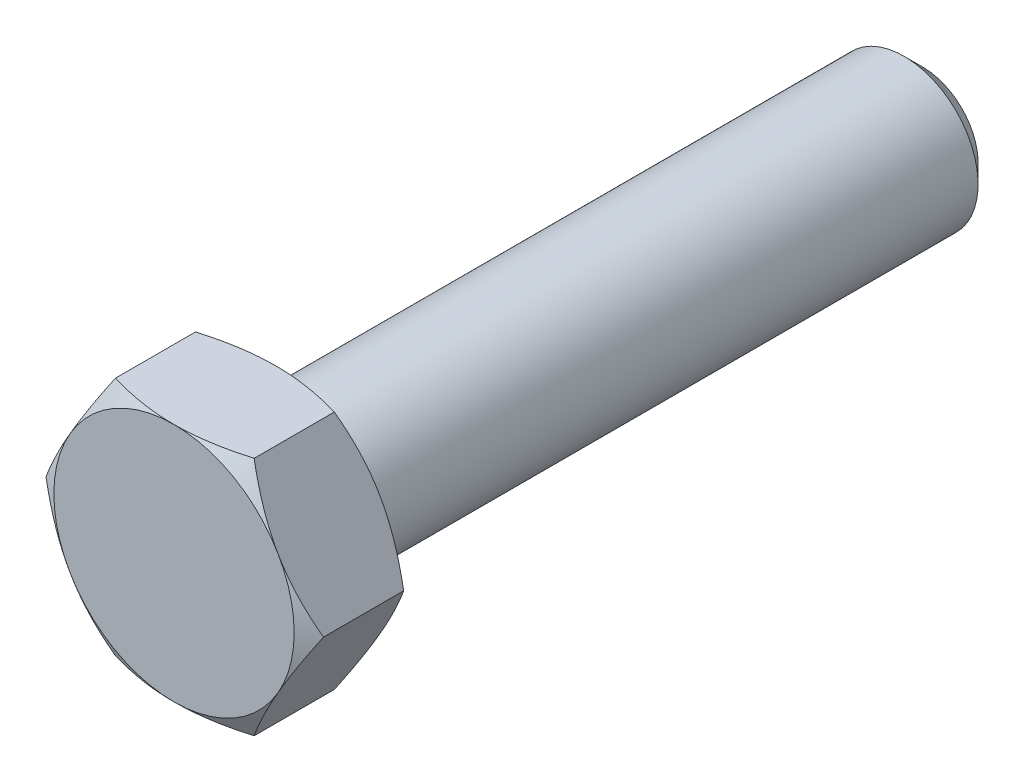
ISO-10303-21;
HEADER;
FILE_DESCRIPTION(('STEP AP214'),'2;1');
FILE_NAME('part.step','',(''),(''),'','','');
FILE_SCHEMA(('AUTOMOTIVE_DESIGN { 1 0 10303 214 1 1 1 1 }'));
ENDSEC;
DATA;
#1=APPLICATION_CONTEXT('core data for automotive mechanical design processes');
#2=APPLICATION_PROTOCOL_DEFINITION('international standard','automotive_design',2000,#1);
#3=PRODUCT_CONTEXT('',#1,'mechanical');
#4=PRODUCT('Part','Part','',(#3));
#5=PRODUCT_RELATED_PRODUCT_CATEGORY('part','',(#4));
#6=PRODUCT_DEFINITION_FORMATION('','',#4);
#7=PRODUCT_DEFINITION_CONTEXT('part definition',#1,'design');
#8=PRODUCT_DEFINITION('design','',#6,#7);
#9=PRODUCT_DEFINITION_SHAPE('','',#8);
#10=(LENGTH_UNIT() NAMED_UNIT(*) SI_UNIT(.MILLI.,.METRE.));
#11=(NAMED_UNIT(*) PLANE_ANGLE_UNIT() SI_UNIT($,.RADIAN.));
#12=(NAMED_UNIT(*) SI_UNIT($,.STERADIAN.) SOLID_ANGLE_UNIT());
#13=UNCERTAINTY_MEASURE_WITH_UNIT(LENGTH_MEASURE(1.E-05),#10,'distance_accuracy_value','');
#14=(GEOMETRIC_REPRESENTATION_CONTEXT(3) GLOBAL_UNCERTAINTY_ASSIGNED_CONTEXT((#13)) GLOBAL_UNIT_ASSIGNED_CONTEXT((#10,
#11,#12)) REPRESENTATION_CONTEXT('',''));
#15=CARTESIAN_POINT('',(0.,0.,0.));
#16=DIRECTION('',(0.,0.,1.));
#17=DIRECTION('',(1.,0.,0.));
#18=AXIS2_PLACEMENT_3D('',#15,#16,#17);
#19=CARTESIAN_POINT('',(0.,13.,0.));
#20=DIRECTION('',(0.,0.,-1.));
#21=DIRECTION('',(-1.,0.,0.));
#22=AXIS2_PLACEMENT_3D('',#19,#20,#21);
#23=PLANE('',#22);
#24=CARTESIAN_POINT('',(0.,0.,0.));
#25=DIRECTION('',(0.,0.,-1.));
#26=DIRECTION('',(-1.,0.,0.));
#27=AXIS2_PLACEMENT_3D('',#24,#25,#26);
#28=CIRCLE('',#27,6.5);
#29=CARTESIAN_POINT('',(-5.62916512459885,-3.25,0.));
#30=VERTEX_POINT('',#29);
#31=CARTESIAN_POINT('',(-5.62916512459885,3.25,0.));
#32=VERTEX_POINT('',#31);
#33=EDGE_CURVE('E310',#30,#32,#28,.T.);
#34=ORIENTED_EDGE('',*,*,#33,.T.);
#35=CARTESIAN_POINT('',(0.,0.,0.));
#36=DIRECTION('',(0.,0.,-1.));
#37=DIRECTION('',(-1.,0.,0.));
#38=AXIS2_PLACEMENT_3D('',#35,#36,#37);
#39=CIRCLE('',#38,6.5);
#40=CARTESIAN_POINT('',(0.,6.5,0.));
#41=VERTEX_POINT('',#40);
#42=EDGE_CURVE('E249',#32,#41,#39,.T.);
#43=ORIENTED_EDGE('',*,*,#42,.T.);
#44=CARTESIAN_POINT('',(5.62916512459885,3.25,0.));
#45=VERTEX_POINT('',#44);
#46=EDGE_CURVE('E142',#41,#45,#28,.T.);
#47=ORIENTED_EDGE('',*,*,#46,.T.);
#48=CARTESIAN_POINT('',(5.62916512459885,-3.25,0.));
#49=VERTEX_POINT('',#48);
#50=EDGE_CURVE('E303',#45,#49,#28,.T.);
#51=ORIENTED_EDGE('',*,*,#50,.T.);
#52=CARTESIAN_POINT('',(0.,-6.5,0.));
#53=VERTEX_POINT('',#52);
#54=EDGE_CURVE('E300',#49,#53,#28,.T.);
#55=ORIENTED_EDGE('',*,*,#54,.T.);
#56=EDGE_CURVE('E304',#53,#30,#28,.T.);
#57=ORIENTED_EDGE('',*,*,#56,.T.);
#58=EDGE_LOOP('',(#34,#43,#47,#51,#55,#57));
#59=FACE_BOUND('',#58,.T.);
#60=CARTESIAN_POINT('',(0.,0.,0.));
#61=DIRECTION('',(0.,0.,-1.));
#62=DIRECTION('',(-1.,0.,0.));
#63=AXIS2_PLACEMENT_3D('',#60,#61,#62);
#64=CIRCLE('',#63,4.);
#65=CARTESIAN_POINT('',(-4.,0.,0.));
#66=VERTEX_POINT('',#65);
#67=EDGE_CURVE('E156',#66,#66,#64,.T.);
#68=ORIENTED_EDGE('',*,*,#67,.F.);
#69=EDGE_LOOP('',(#68));
#70=FACE_BOUND('',#69,.T.);
#71=ADVANCED_FACE('F32',(#59,#70),#23,.T.);
#72=CARTESIAN_POINT('',(-7.50555349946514,0.,5.5));
#73=DIRECTION('',(-0.866025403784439,0.5,0.));
#74=DIRECTION('',(-0.5,-0.866025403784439,0.));
#75=AXIS2_PLACEMENT_3D('',#72,#73,#74);
#76=PLANE('',#75);
#77=DIRECTION('',(0.,0.,-1.));
#78=VECTOR('',#77,1.);
#79=CARTESIAN_POINT('',(-7.50555349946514,0.,5.5));
#80=LINE('',#79,#78);
#81=CARTESIAN_POINT('',(-7.50555349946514,0.,4.91944341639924));
#82=VERTEX_POINT('',#81);
#83=CARTESIAN_POINT('',(-7.50555349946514,0.,0.580556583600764));
#84=VERTEX_POINT('',#83);
#85=EDGE_CURVE('E312',#82,#84,#80,.T.);
#86=ORIENTED_EDGE('',*,*,#85,.F.);
#87=CARTESIAN_POINT('',(-7.50566896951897,-0.000200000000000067,4.91937674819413));
#88=CARTESIAN_POINT('',(-7.4231786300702,0.142677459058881,4.96699557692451));
#89=CARTESIAN_POINT('',(-7.34038072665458,0.286087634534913,5.01245329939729));
#90=CARTESIAN_POINT('',(-7.17411251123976,0.574072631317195,5.09845131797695));
#91=CARTESIAN_POINT('',(-7.09064192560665,0.718647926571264,5.13898949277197));
#92=CARTESIAN_POINT('',(-6.83889369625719,1.15468865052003,5.25242899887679));
#93=CARTESIAN_POINT('',(-6.66962231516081,1.44787528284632,5.31695219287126));
#94=CARTESIAN_POINT('',(-6.41631077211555,1.88662374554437,5.39261341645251));
#95=CARTESIAN_POINT('',(-6.33302748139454,2.03087463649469,5.41416714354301));
#96=CARTESIAN_POINT('',(-6.16608458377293,2.32002821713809,5.45030968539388));
#97=CARTESIAN_POINT('',(-6.08242501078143,2.46493084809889,5.46489911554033));
#98=CARTESIAN_POINT('',(-5.91496056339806,2.75498777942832,5.48674124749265));
#99=CARTESIAN_POINT('',(-5.8311559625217,2.90014160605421,5.49400227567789));
#100=CARTESIAN_POINT('',(-5.66347396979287,3.19057533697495,5.50103969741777));
#101=CARTESIAN_POINT('',(-5.5795965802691,3.33585523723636,5.50081632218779));
#102=CARTESIAN_POINT('',(-5.34979921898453,3.73387594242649,5.48991654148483));
#103=CARTESIAN_POINT('',(-5.20395446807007,3.98648646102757,5.47161818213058));
#104=CARTESIAN_POINT('',(-4.91323365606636,4.49002967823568,5.41359365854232));
#105=CARTESIAN_POINT('',(-4.76835861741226,4.74096060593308,5.37384766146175));
#106=CARTESIAN_POINT('',(-4.47705272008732,5.24551722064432,5.27449409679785));
#107=CARTESIAN_POINT('',(-4.33065861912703,5.49907924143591,5.21446557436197));
#108=CARTESIAN_POINT('',(-4.04005357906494,6.00242193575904,5.07822500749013));
#109=CARTESIAN_POINT('',(-3.89583891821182,6.25220905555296,5.00204496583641));
#110=CARTESIAN_POINT('',(-3.75266127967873,6.5002,4.91937674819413));
#111=B_SPLINE_CURVE_WITH_KNOTS('',3,(#87,#88,#89,#90,#91,#92,#93,#94,#95,#96,#97,#98,#99,#100,
#101,#102,#103,#104,#105,#106,#107,#108,#109,#110),.UNSPECIFIED.,.F.,.F.,(4,2,2,2,2,2,2,2,2,2,2,
4),(0.,0.515105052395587,1.03043143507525,2.06322554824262,2.56697389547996,3.07067772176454,
3.57380860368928,4.0769239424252,4.9527935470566,5.82947446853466,6.72559912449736,
7.61996451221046),.UNSPECIFIED.);
#112=CARTESIAN_POINT('',(-5.62916512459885,3.25,5.5));
#113=VERTEX_POINT('',#112);
#114=EDGE_CURVE('E233',#82,#113,#111,.T.);
#115=ORIENTED_EDGE('',*,*,#114,.T.);
#116=CARTESIAN_POINT('',(-3.75277674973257,6.5,4.91944341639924));
#117=VERTEX_POINT('',#116);
#118=EDGE_CURVE('E129',#113,#117,#111,.T.);
#119=ORIENTED_EDGE('',*,*,#118,.T.);
#120=DIRECTION('',(0.,0.,-1.));
#121=VECTOR('',#120,1.);
#122=CARTESIAN_POINT('',(-3.75277674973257,6.5,5.5));
#123=LINE('',#122,#121);
#124=CARTESIAN_POINT('',(-3.75277674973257,6.5,0.580556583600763));
#125=VERTEX_POINT('',#124);
#126=EDGE_CURVE('E147',#117,#125,#123,.T.);
#127=ORIENTED_EDGE('',*,*,#126,.T.);
#128=CARTESIAN_POINT('',(-3.75266127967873,6.5002,0.580623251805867));
#129=CARTESIAN_POINT('',(-3.8351516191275,6.35732254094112,0.533004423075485));
#130=CARTESIAN_POINT('',(-3.91794952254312,6.21391236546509,0.487546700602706));
#131=CARTESIAN_POINT('',(-4.08421773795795,5.9259273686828,0.401548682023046));
#132=CARTESIAN_POINT('',(-4.16768832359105,5.78135207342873,0.361010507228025));
#133=CARTESIAN_POINT('',(-4.41943655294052,5.34531134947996,0.247571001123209));
#134=CARTESIAN_POINT('',(-4.5887079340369,5.05212471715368,0.18304780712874));
#135=CARTESIAN_POINT('',(-4.84201947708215,4.61337625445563,0.107386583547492));
#136=CARTESIAN_POINT('',(-4.92530276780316,4.46912536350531,0.0858328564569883));
#137=CARTESIAN_POINT('',(-5.09224566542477,4.17997178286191,0.0496903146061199));
#138=CARTESIAN_POINT('',(-5.17590523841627,4.03506915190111,0.0351008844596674));
#139=CARTESIAN_POINT('',(-5.34336968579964,3.74501222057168,0.0132587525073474));
#140=CARTESIAN_POINT('',(-5.427174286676,3.59985839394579,0.00599772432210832));
#141=CARTESIAN_POINT('',(-5.59485627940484,3.30942466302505,-0.00103969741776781));
#142=CARTESIAN_POINT('',(-5.6787336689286,3.16414476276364,-0.000816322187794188));
#143=CARTESIAN_POINT('',(-5.90853103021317,2.7661240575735,0.0100834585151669));
#144=CARTESIAN_POINT('',(-6.05437578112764,2.51351353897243,0.0283818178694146));
#145=CARTESIAN_POINT('',(-6.34509659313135,2.00997032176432,0.0864063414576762));
#146=CARTESIAN_POINT('',(-6.48997163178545,1.75903939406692,0.126152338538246));
#147=CARTESIAN_POINT('',(-6.78127752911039,1.25448277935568,0.225505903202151));
#148=CARTESIAN_POINT('',(-6.92767163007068,1.00092075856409,0.285534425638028));
#149=CARTESIAN_POINT('',(-7.21827667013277,0.497578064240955,0.421774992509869));
#150=CARTESIAN_POINT('',(-7.36249133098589,0.247790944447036,0.497955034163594));
#151=CARTESIAN_POINT('',(-7.50566896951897,-0.00020000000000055,0.580623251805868));
#152=B_SPLINE_CURVE_WITH_KNOTS('',3,(#128,#129,#130,#131,#132,#133,#134,#135,#136,#137,#138,
#139,#140,#141,#142,#143,#144,#145,#146,#147,#148,#149,#150,#151),.UNSPECIFIED.,.F.,.F.,(4,2,2,
2,2,2,2,2,2,2,2,4),(0.,0.515105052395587,1.03043143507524,2.06322554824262,2.56697389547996,
3.07067772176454,3.57380860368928,4.0769239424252,4.9527935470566,5.82947446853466,
6.72559912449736,7.61996451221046),.UNSPECIFIED.);
#153=EDGE_CURVE('E315',#125,#32,#152,.T.);
#154=ORIENTED_EDGE('',*,*,#153,.T.);
#155=EDGE_CURVE('E322',#32,#84,#152,.T.);
#156=ORIENTED_EDGE('',*,*,#155,.T.);
#157=EDGE_LOOP('',(#86,#115,#119,#127,#154,#156));
#158=FACE_BOUND('',#157,.T.);
#159=ADVANCED_FACE('F34',(#158),#76,.T.);
#160=CARTESIAN_POINT('',(-3.75277674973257,-6.5,5.5));
#161=DIRECTION('',(-0.866025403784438,-0.500000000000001,0.));
#162=DIRECTION('',(0.500000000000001,-0.866025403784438,0.));
#163=AXIS2_PLACEMENT_3D('',#160,#161,#162);
#164=PLANE('',#163);
#165=DIRECTION('',(0.,0.,-1.));
#166=VECTOR('',#165,1.);
#167=CARTESIAN_POINT('',(-3.75277674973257,-6.5,5.5));
#168=LINE('',#167,#166);
#169=CARTESIAN_POINT('',(-3.75277674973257,-6.5,4.91944341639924));
#170=VERTEX_POINT('',#169);
#171=CARTESIAN_POINT('',(-3.75277674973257,-6.5,0.580556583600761));
#172=VERTEX_POINT('',#171);
#173=EDGE_CURVE('E320',#170,#172,#168,.T.);
#174=ORIENTED_EDGE('',*,*,#173,.F.);
#175=CARTESIAN_POINT('',(-3.75266127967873,-6.5002,4.91937674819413));
#176=CARTESIAN_POINT('',(-3.8351516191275,-6.35732254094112,4.96699557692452));
#177=CARTESIAN_POINT('',(-3.91794952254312,-6.21391236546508,5.01245329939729));
#178=CARTESIAN_POINT('',(-4.08421773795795,-5.9259273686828,5.09845131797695));
#179=CARTESIAN_POINT('',(-4.16768832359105,-5.78135207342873,5.13898949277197));
#180=CARTESIAN_POINT('',(-4.41943655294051,-5.34531134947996,5.25242899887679));
#181=CARTESIAN_POINT('',(-4.5887079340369,-5.05212471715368,5.31695219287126));
#182=CARTESIAN_POINT('',(-4.84201947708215,-4.61337625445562,5.39261341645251));
#183=CARTESIAN_POINT('',(-4.92530276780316,-4.46912536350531,5.41416714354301));
#184=CARTESIAN_POINT('',(-5.09224566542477,-4.17997178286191,5.45030968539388));
#185=CARTESIAN_POINT('',(-5.17590523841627,-4.03506915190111,5.46489911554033));
#186=CARTESIAN_POINT('',(-5.34336968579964,-3.74501222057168,5.48674124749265));
#187=CARTESIAN_POINT('',(-5.427174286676,-3.59985839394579,5.49400227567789));
#188=CARTESIAN_POINT('',(-5.59485627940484,-3.30942466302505,5.50103969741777));
#189=CARTESIAN_POINT('',(-5.6787336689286,-3.16414476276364,5.5008163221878));
#190=CARTESIAN_POINT('',(-5.90853103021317,-2.7661240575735,5.48991654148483));
#191=CARTESIAN_POINT('',(-6.05437578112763,-2.51351353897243,5.47161818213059));
#192=CARTESIAN_POINT('',(-6.34509659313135,-2.00997032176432,5.41359365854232));
#193=CARTESIAN_POINT('',(-6.48997163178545,-1.75903939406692,5.37384766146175));
#194=CARTESIAN_POINT('',(-6.78127752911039,-1.25448277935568,5.27449409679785));
#195=CARTESIAN_POINT('',(-6.92767163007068,-1.00092075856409,5.21446557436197));
#196=CARTESIAN_POINT('',(-7.21827667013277,-0.497578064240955,5.07822500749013));
#197=CARTESIAN_POINT('',(-7.36249133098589,-0.247790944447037,5.00204496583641));
#198=CARTESIAN_POINT('',(-7.50566896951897,0.00019999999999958,4.91937674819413));
#199=B_SPLINE_CURVE_WITH_KNOTS('',3,(#175,#176,#177,#178,#179,#180,#181,#182,#183,#184,#185,
#186,#187,#188,#189,#190,#191,#192,#193,#194,#195,#196,#197,#198),.UNSPECIFIED.,.F.,.F.,(4,2,2,
2,2,2,2,2,2,2,2,4),(0.,0.515105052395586,1.03043143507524,2.06322554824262,2.56697389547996,
3.07067772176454,3.57380860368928,4.0769239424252,4.9527935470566,5.82947446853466,
6.72559912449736,7.61996451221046),.UNSPECIFIED.);
#200=CARTESIAN_POINT('',(-5.62916512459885,-3.25,5.5));
#201=VERTEX_POINT('',#200);
#202=EDGE_CURVE('E56',#170,#201,#199,.T.);
#203=ORIENTED_EDGE('',*,*,#202,.T.);
#204=EDGE_CURVE('E195',#201,#82,#199,.T.);
#205=ORIENTED_EDGE('',*,*,#204,.T.);
#206=ORIENTED_EDGE('',*,*,#85,.T.);
#207=CARTESIAN_POINT('',(-7.50566896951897,0.0002,0.580623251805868));
#208=CARTESIAN_POINT('',(-7.4231786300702,-0.142677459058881,0.533004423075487));
#209=CARTESIAN_POINT('',(-7.34038072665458,-0.286087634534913,0.487546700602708));
#210=CARTESIAN_POINT('',(-7.17411251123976,-0.574072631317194,0.401548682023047));
#211=CARTESIAN_POINT('',(-7.09064192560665,-0.718647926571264,0.361010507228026));
#212=CARTESIAN_POINT('',(-6.83889369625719,-1.15468865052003,0.247571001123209));
#213=CARTESIAN_POINT('',(-6.66962231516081,-1.44787528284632,0.18304780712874));
#214=CARTESIAN_POINT('',(-6.41631077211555,-1.88662374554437,0.107386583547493));
#215=CARTESIAN_POINT('',(-6.33302748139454,-2.03087463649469,0.0858328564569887));
#216=CARTESIAN_POINT('',(-6.16608458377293,-2.32002821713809,0.0496903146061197));
#217=CARTESIAN_POINT('',(-6.08242501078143,-2.46493084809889,0.0351008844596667));
#218=CARTESIAN_POINT('',(-5.91496056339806,-2.75498777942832,0.013258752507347));
#219=CARTESIAN_POINT('',(-5.8311559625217,-2.90014160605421,0.00599772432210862));
#220=CARTESIAN_POINT('',(-5.66347396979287,-3.19057533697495,-0.00103969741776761));
#221=CARTESIAN_POINT('',(-5.5795965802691,-3.33585523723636,-0.000816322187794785));
#222=CARTESIAN_POINT('',(-5.34979921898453,-3.73387594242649,0.0100834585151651));
#223=CARTESIAN_POINT('',(-5.20395446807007,-3.98648646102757,0.0283818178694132));
#224=CARTESIAN_POINT('',(-4.91323365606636,-4.49002967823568,0.0864063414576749));
#225=CARTESIAN_POINT('',(-4.76835861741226,-4.74096060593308,0.126152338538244));
#226=CARTESIAN_POINT('',(-4.47705272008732,-5.24551722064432,0.225505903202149));
#227=CARTESIAN_POINT('',(-4.33065861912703,-5.49907924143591,0.285534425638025));
#228=CARTESIAN_POINT('',(-4.04005357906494,-6.00242193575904,0.421774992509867));
#229=CARTESIAN_POINT('',(-3.89583891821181,-6.25220905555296,0.497955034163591));
#230=CARTESIAN_POINT('',(-3.75266127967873,-6.5002,0.580623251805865));
#231=B_SPLINE_CURVE_WITH_KNOTS('',3,(#207,#208,#209,#210,#211,#212,#213,#214,#215,#216,#217,
#218,#219,#220,#221,#222,#223,#224,#225,#226,#227,#228,#229,#230),.UNSPECIFIED.,.F.,.F.,(4,2,2,
2,2,2,2,2,2,2,2,4),(0.,0.515105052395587,1.03043143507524,2.06322554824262,2.56697389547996,
3.07067772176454,3.57380860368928,4.0769239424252,4.9527935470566,5.82947446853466,
6.72559912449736,7.61996451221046),.UNSPECIFIED.);
#232=EDGE_CURVE('E327',#84,#30,#231,.T.);
#233=ORIENTED_EDGE('',*,*,#232,.T.);
#234=EDGE_CURVE('E188',#30,#172,#231,.T.);
#235=ORIENTED_EDGE('',*,*,#234,.T.);
#236=EDGE_LOOP('',(#174,#203,#205,#206,#233,#235));
#237=FACE_BOUND('',#236,.T.);
#238=ADVANCED_FACE('F169',(#237),#164,.T.);
#239=CARTESIAN_POINT('',(3.75277674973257,-6.5,5.5));
#240=DIRECTION('',(0.,-1.,0.));
#241=DIRECTION('',(1.,0.,0.));
#242=AXIS2_PLACEMENT_3D('',#239,#240,#241);
#243=PLANE('',#242);
#244=DIRECTION('',(0.,0.,-1.));
#245=VECTOR('',#244,1.);
#246=CARTESIAN_POINT('',(3.75277674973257,-6.5,5.5));
#247=LINE('',#246,#245);
#248=CARTESIAN_POINT('',(3.75277674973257,-6.5,4.91944341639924));
#249=VERTEX_POINT('',#248);
#250=CARTESIAN_POINT('',(3.75277674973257,-6.5,0.580556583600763));
#251=VERTEX_POINT('',#250);
#252=EDGE_CURVE('E294',#249,#251,#247,.T.);
#253=ORIENTED_EDGE('',*,*,#252,.F.);
#254=CARTESIAN_POINT('',(-9.97729078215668,-6.5,2.37778992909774));
#255=CARTESIAN_POINT('',(-9.69424196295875,-6.5,2.51467602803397));
#256=CARTESIAN_POINT('',(-9.41053219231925,-6.5,2.65021940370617));
#257=CARTESIAN_POINT('',(-8.84143883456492,-6.5,2.9178633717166));
#258=CARTESIAN_POINT('',(-8.55605498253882,-6.5,3.04996340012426));
#259=CARTESIAN_POINT('',(-7.98174100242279,-6.5,3.31065019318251));
#260=CARTESIAN_POINT('',(-7.69279995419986,-6.5,3.43921298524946));
#261=CARTESIAN_POINT('',(-7.11258334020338,-6.5,3.69093759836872));
#262=CARTESIAN_POINT('',(-6.82130788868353,-6.5,3.81409968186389));
#263=CARTESIAN_POINT('',(-6.22696298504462,-6.5,4.05727415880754));
#264=CARTESIAN_POINT('',(-5.92380598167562,-6.5,4.17707377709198));
#265=CARTESIAN_POINT('',(-5.3139080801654,-6.5,4.4073538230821));
#266=CARTESIAN_POINT('',(-5.00716677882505,-6.5,4.5178331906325));
#267=CARTESIAN_POINT('',(-4.3902168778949,-6.5,4.7264961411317));
#268=CARTESIAN_POINT('',(-4.08001710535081,-6.5,4.82470553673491));
#269=CARTESIAN_POINT('',(-3.4551811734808,-6.5,5.00561092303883));
#270=CARTESIAN_POINT('',(-3.14054647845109,-6.5,5.08831191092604));
#271=CARTESIAN_POINT('',(-2.50833584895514,-6.5,5.23372427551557));
#272=CARTESIAN_POINT('',(-2.19078462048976,-6.5,5.29654012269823));
#273=CARTESIAN_POINT('',(-1.71165005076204,-6.5,5.37308014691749));
#274=CARTESIAN_POINT('',(-1.55145779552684,-6.5,5.39564728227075));
#275=CARTESIAN_POINT('',(-1.2303133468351,-6.5,5.43444204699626));
#276=CARTESIAN_POINT('',(-1.06936123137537,-6.5,5.45067031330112));
#277=CARTESIAN_POINT('',(-0.748968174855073,-6.5,5.47626594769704));
#278=CARTESIAN_POINT('',(-0.589534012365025,-6.5,5.48571785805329));
#279=CARTESIAN_POINT('',(-0.270409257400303,-6.5,5.49787883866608));
#280=CARTESIAN_POINT('',(-0.110718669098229,-6.5,5.50058801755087));
#281=CARTESIAN_POINT('',(0.208634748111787,-6.5,5.49919908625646));
#282=CARTESIAN_POINT('',(0.368297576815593,-6.5,5.49510092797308));
#283=CARTESIAN_POINT('',(0.687311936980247,-6.5,5.48019557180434));
#284=CARTESIAN_POINT('',(0.846663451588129,-6.5,5.46938802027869));
#285=CARTESIAN_POINT('',(1.23282228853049,-6.5,5.43529329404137));
#286=CARTESIAN_POINT('',(1.45933886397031,-6.5,5.40864596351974));
#287=CARTESIAN_POINT('',(1.91061150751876,-6.5,5.34327257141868));
#288=CARTESIAN_POINT('',(2.1353673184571,-6.5,5.30454477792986));
#289=CARTESIAN_POINT('',(2.80678176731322,-6.5,5.17230120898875));
#290=CARTESIAN_POINT('',(3.25031976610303,-6.5,5.0627519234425));
#291=CARTESIAN_POINT('',(3.91338278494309,-6.5,4.87379149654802));
#292=CARTESIAN_POINT('',(4.13637192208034,-6.5,4.80584530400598));
#293=CARTESIAN_POINT('',(4.58018302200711,-6.5,4.66314671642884));
#294=CARTESIAN_POINT('',(4.80100497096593,-6.5,4.58839427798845));
#295=CARTESIAN_POINT('',(5.24055596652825,-6.5,4.43326153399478));
#296=CARTESIAN_POINT('',(5.45928573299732,-6.5,4.35288324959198));
#297=CARTESIAN_POINT('',(5.8949502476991,-6.5,4.18741937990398));
#298=CARTESIAN_POINT('',(6.11188501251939,-6.5,4.10233383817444));
#299=CARTESIAN_POINT('',(6.60444885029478,-6.5,3.90396155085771));
#300=CARTESIAN_POINT('',(6.87957453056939,-6.5,3.78942755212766));
#301=CARTESIAN_POINT('',(7.42764194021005,-6.5,3.55523525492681));
#302=CARTESIAN_POINT('',(7.70058356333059,-6.5,3.43557670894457));
#303=CARTESIAN_POINT('',(8.24466177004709,-6.5,3.19211434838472));
#304=CARTESIAN_POINT('',(8.51579804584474,-6.5,3.06830984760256));
#305=CARTESIAN_POINT('',(9.05651181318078,-6.5,2.81733776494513));
#306=CARTESIAN_POINT('',(9.32608927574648,-6.5,2.69017012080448));
#307=CARTESIAN_POINT('',(10.1333173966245,-6.5,2.30433583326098));
#308=CARTESIAN_POINT('',(10.6689977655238,-6.5,2.04154902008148));
#309=CARTESIAN_POINT('',(11.7365775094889,-6.5,1.50840571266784));
#310=CARTESIAN_POINT('',(12.2684767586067,-6.5,1.23804896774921));
#311=CARTESIAN_POINT('',(13.043539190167,-6.5,0.839062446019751));
#312=CARTESIAN_POINT('',(13.2878118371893,-6.5,0.712581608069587));
#313=CARTESIAN_POINT('',(13.7758255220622,-6.5,0.458608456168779));
#314=CARTESIAN_POINT('',(14.0195665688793,-6.5,0.331116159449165));
#315=CARTESIAN_POINT('',(14.7501146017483,-6.5,-0.0526879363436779));
#316=CARTESIAN_POINT('',(15.2362291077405,-6.5,-0.310317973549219));
#317=CARTESIAN_POINT('',(16.2059474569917,-6.5,-0.827706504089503));
#318=CARTESIAN_POINT('',(16.6895544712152,-6.5,-1.0874590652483));
#319=CARTESIAN_POINT('',(17.6555855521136,-6.5,-1.60909930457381));
#320=CARTESIAN_POINT('',(18.138009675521,-6.5,-1.87098687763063));
#321=CARTESIAN_POINT('',(18.6199925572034,-6.5,-2.13367898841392));
#322=B_SPLINE_CURVE_WITH_KNOTS('',3,(#254,#255,#256,#257,#258,#259,#260,#261,#262,#263,#264,
#265,#266,#267,#268,#269,#270,#271,#272,#273,#274,#275,#276,#277,#278,#279,#280,#281,#282,#283,
#284,#285,#286,#287,#288,#289,#290,#291,#292,#293,#294,#295,#296,#297,#298,#299,#300,#301,#302,
#303,#304,#305,#306,#307,#308,#309,#310,#311,#312,#313,#314,#315,#316,#317,#318,#319,#320,#321),
.UNSPECIFIED.,.F.,.F.,(4,2,2,2,2,2,2,2,2,2,2,2,2,2,2,2,2,2,2,2,2,2,2,2,2,2,2,2,2,2,2,2,2,4),(0.,
0.943245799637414,1.88664511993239,2.83535686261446,3.78402245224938,4.761812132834,
5.73971288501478,6.71552046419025,7.69101307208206,8.66129224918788,9.14650857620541,
9.63167613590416,10.1106800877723,10.5896763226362,11.0686759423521,11.5477008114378,
12.2315479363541,12.9154931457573,14.2841869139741,14.9834656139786,15.6827487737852,
16.3817819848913,17.0808087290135,17.9747819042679,18.8687983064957,19.7629634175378,
20.6571450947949,22.4470430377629,24.2370003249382,25.0622248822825,25.8874354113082,
27.5379151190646,29.1847624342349,30.831529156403),.UNSPECIFIED.);
#323=CARTESIAN_POINT('',(0.,-6.5,5.5));
#324=VERTEX_POINT('',#323);
#325=EDGE_CURVE('E245',#249,#324,#322,.F.);
#326=ORIENTED_EDGE('',*,*,#325,.T.);
#327=EDGE_CURVE('E206',#324,#170,#322,.F.);
#328=ORIENTED_EDGE('',*,*,#327,.T.);
#329=ORIENTED_EDGE('',*,*,#173,.T.);
#330=CARTESIAN_POINT('',(-9.97058141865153,-6.5,3.11896475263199));
#331=CARTESIAN_POINT('',(-9.68505665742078,-6.5,2.98091016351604));
#332=CARTESIAN_POINT('',(-9.39885881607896,-6.5,2.84422254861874));
#333=CARTESIAN_POINT('',(-8.82475313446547,-6.5,2.57436199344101));
#334=CARTESIAN_POINT('',(-8.53684501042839,-6.5,2.44118965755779));
#335=CARTESIAN_POINT('',(-7.95740836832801,-6.5,2.17844267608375));
#336=CARTESIAN_POINT('',(-7.66586857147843,-6.5,2.04889281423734));
#337=CARTESIAN_POINT('',(-7.08039928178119,-6.5,1.79533218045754));
#338=CARTESIAN_POINT('',(-6.78646991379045,-6.5,1.67132112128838));
#339=CARTESIAN_POINT('',(-6.19202314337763,-6.5,1.42880427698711));
#340=CARTESIAN_POINT('',(-5.89146936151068,-6.5,1.31038717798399));
#341=CARTESIAN_POINT('',(-5.28682280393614,-6.5,1.08278341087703));
#342=CARTESIAN_POINT('',(-4.98272963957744,-6.5,0.973597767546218));
#343=CARTESIAN_POINT('',(-4.37114030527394,-6.5,0.767377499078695));
#344=CARTESIAN_POINT('',(-4.06365288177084,-6.5,0.670317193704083));
#345=CARTESIAN_POINT('',(-3.44430270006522,-6.5,0.491489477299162));
#346=CARTESIAN_POINT('',(-3.13244135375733,-6.5,0.409717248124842));
#347=CARTESIAN_POINT('',(-2.50415266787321,-6.5,0.265421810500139));
#348=CARTESIAN_POINT('',(-2.18772435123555,-6.5,0.20290278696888));
#349=CARTESIAN_POINT('',(-1.55098857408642,-6.5,0.101323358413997));
#350=CARTESIAN_POINT('',(-1.23068111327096,-6.5,0.0622629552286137));
#351=CARTESIAN_POINT('',(-0.749699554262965,-6.5,0.0237698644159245));
#352=CARTESIAN_POINT('',(-0.589789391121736,-6.5,0.0142870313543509));
#353=CARTESIAN_POINT('',(-0.269703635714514,-6.5,0.00209911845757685));
#354=CARTESIAN_POINT('',(-0.109528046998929,-6.5,-0.000606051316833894));
#355=CARTESIAN_POINT('',(0.21074553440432,-6.5,0.000833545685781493));
#356=CARTESIAN_POINT('',(0.370843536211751,-6.5,0.00497636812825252));
#357=CARTESIAN_POINT('',(0.69072549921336,-6.5,0.0200063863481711));
#358=CARTESIAN_POINT('',(0.850509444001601,-6.5,0.0308939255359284));
#359=CARTESIAN_POINT('',(1.23721068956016,-6.5,0.0651780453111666));
#360=CARTESIAN_POINT('',(1.4638360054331,-6.5,0.0919226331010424));
#361=CARTESIAN_POINT('',(1.91536203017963,-6.5,0.15750031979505));
#362=CARTESIAN_POINT('',(2.14026225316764,-6.5,0.196336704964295));
#363=CARTESIAN_POINT('',(2.58814846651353,-6.5,0.284720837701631));
#364=CARTESIAN_POINT('',(2.81113244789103,-6.5,0.334278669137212));
#365=CARTESIAN_POINT('',(3.25481181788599,-6.5,0.442592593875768));
#366=CARTESIAN_POINT('',(3.47550741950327,-6.5,0.50134782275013));
#367=CARTESIAN_POINT('',(3.92006995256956,-6.5,0.628192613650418));
#368=CARTESIAN_POINT('',(4.14388106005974,-6.5,0.696476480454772));
#369=CARTESIAN_POINT('',(4.58913797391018,-6.5,0.839828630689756));
#370=CARTESIAN_POINT('',(4.81058529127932,-6.5,0.914892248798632));
#371=CARTESIAN_POINT('',(5.25022638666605,-6.5,1.07025024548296));
#372=CARTESIAN_POINT('',(5.46843145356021,-6.5,1.15051287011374));
#373=CARTESIAN_POINT('',(5.90314543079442,-6.5,1.31577333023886));
#374=CARTESIAN_POINT('',(6.11965362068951,-6.5,1.40077306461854));
#375=CARTESIAN_POINT('',(6.33537360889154,-6.5,1.48767357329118));
#376=B_SPLINE_CURVE_WITH_KNOTS('',3,(#330,#331,#332,#333,#334,#335,#336,#337,#338,#339,#340,
#341,#342,#343,#344,#345,#346,#347,#348,#349,#350,#351,#352,#353,#354,#355,#356,#357,#358,#359,
#360,#361,#362,#363,#364,#365,#366,#367,#368,#369,#370,#371,#372,#373,#374,#375),.UNSPECIFIED.,
.F.,.F.,(4,2,2,2,2,2,2,2,2,2,2,2,2,2,2,2,2,2,2,2,2,2,4),(0.,0.951459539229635,1.90308161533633,
2.86011866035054,3.81710601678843,4.78611054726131,5.75522250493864,6.72224587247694,
7.68896396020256,8.65589202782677,9.6228201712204,10.1032714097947,10.5837162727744,
11.0640247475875,11.5443576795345,12.2285708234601,12.9129700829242,13.5980158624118,
14.2829972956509,14.9848544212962,15.6862322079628,16.3836698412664,17.0813890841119),.UNSPECIFIED.);
#377=EDGE_CURVE('E290',#172,#53,#376,.T.);
#378=ORIENTED_EDGE('',*,*,#377,.T.);
#379=EDGE_CURVE('E285',#53,#251,#376,.T.);
#380=ORIENTED_EDGE('',*,*,#379,.T.);
#381=EDGE_LOOP('',(#253,#326,#328,#329,#378,#380));
#382=FACE_BOUND('',#381,.T.);
#383=ADVANCED_FACE('F183',(#382),#243,.T.);
#384=CARTESIAN_POINT('',(7.50555349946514,0.,5.5));
#385=DIRECTION('',(0.866025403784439,-0.5,0.));
#386=DIRECTION('',(0.5,0.866025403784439,0.));
#387=AXIS2_PLACEMENT_3D('',#384,#385,#386);
#388=PLANE('',#387);
#389=DIRECTION('',(0.,0.,-1.));
#390=VECTOR('',#389,1.);
#391=CARTESIAN_POINT('',(7.50555349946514,0.,5.5));
#392=LINE('',#391,#390);
#393=CARTESIAN_POINT('',(7.50555349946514,0.,4.91944341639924));
#394=VERTEX_POINT('',#393);
#395=CARTESIAN_POINT('',(7.50555349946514,0.,0.580556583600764));
#396=VERTEX_POINT('',#395);
#397=EDGE_CURVE('E317',#394,#396,#392,.T.);
#398=ORIENTED_EDGE('',*,*,#397,.F.);
#399=CARTESIAN_POINT('',(7.50566896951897,0.000200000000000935,4.91937674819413));
#400=CARTESIAN_POINT('',(7.4231786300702,-0.14267745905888,4.96699557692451));
#401=CARTESIAN_POINT('',(7.34038072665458,-0.286087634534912,5.01245329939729));
#402=CARTESIAN_POINT('',(7.17411251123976,-0.574072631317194,5.09845131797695));
#403=CARTESIAN_POINT('',(7.09064192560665,-0.718647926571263,5.13898949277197));
#404=CARTESIAN_POINT('',(6.83889369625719,-1.15468865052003,5.25242899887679));
#405=CARTESIAN_POINT('',(6.66962231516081,-1.44787528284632,5.31695219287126));
#406=CARTESIAN_POINT('',(6.41631077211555,-1.88662374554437,5.39261341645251));
#407=CARTESIAN_POINT('',(6.33302748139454,-2.03087463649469,5.41416714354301));
#408=CARTESIAN_POINT('',(6.16608458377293,-2.32002821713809,5.45030968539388));
#409=CARTESIAN_POINT('',(6.08242501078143,-2.46493084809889,5.46489911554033));
#410=CARTESIAN_POINT('',(5.91496056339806,-2.75498777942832,5.48674124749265));
#411=CARTESIAN_POINT('',(5.8311559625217,-2.90014160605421,5.49400227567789));
#412=CARTESIAN_POINT('',(5.66347396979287,-3.19057533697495,5.50103969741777));
#413=CARTESIAN_POINT('',(5.5795965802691,-3.33585523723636,5.50081632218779));
#414=CARTESIAN_POINT('',(5.34979921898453,-3.73387594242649,5.48991654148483));
#415=CARTESIAN_POINT('',(5.20395446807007,-3.98648646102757,5.47161818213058));
#416=CARTESIAN_POINT('',(4.91323365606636,-4.49002967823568,5.41359365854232));
#417=CARTESIAN_POINT('',(4.76835861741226,-4.74096060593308,5.37384766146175));
#418=CARTESIAN_POINT('',(4.47705272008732,-5.24551722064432,5.27449409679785));
#419=CARTESIAN_POINT('',(4.33065861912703,-5.49907924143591,5.21446557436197));
#420=CARTESIAN_POINT('',(4.04005357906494,-6.00242193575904,5.07822500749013));
#421=CARTESIAN_POINT('',(3.89583891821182,-6.25220905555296,5.00204496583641));
#422=CARTESIAN_POINT('',(3.75266127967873,-6.5002,4.91937674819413));
#423=B_SPLINE_CURVE_WITH_KNOTS('',3,(#399,#400,#401,#402,#403,#404,#405,#406,#407,#408,#409,
#410,#411,#412,#413,#414,#415,#416,#417,#418,#419,#420,#421,#422),.UNSPECIFIED.,.F.,.F.,(4,2,2,
2,2,2,2,2,2,2,2,4),(0.,0.515105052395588,1.03043143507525,2.06322554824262,2.56697389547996,
3.07067772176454,3.57380860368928,4.0769239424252,4.9527935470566,5.82947446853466,
6.72559912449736,7.61996451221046),.UNSPECIFIED.);
#424=CARTESIAN_POINT('',(5.62916512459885,-3.25,5.5));
#425=VERTEX_POINT('',#424);
#426=EDGE_CURVE('E201',#394,#425,#423,.T.);
#427=ORIENTED_EDGE('',*,*,#426,.T.);
#428=EDGE_CURVE('E239',#425,#249,#423,.T.);
#429=ORIENTED_EDGE('',*,*,#428,.T.);
#430=ORIENTED_EDGE('',*,*,#252,.T.);
#431=CARTESIAN_POINT('',(3.75266127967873,-6.5002,0.580623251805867));
#432=CARTESIAN_POINT('',(3.83515161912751,-6.35732254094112,0.533004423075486));
#433=CARTESIAN_POINT('',(3.91794952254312,-6.21391236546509,0.487546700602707));
#434=CARTESIAN_POINT('',(4.08421773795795,-5.9259273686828,0.401548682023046));
#435=CARTESIAN_POINT('',(4.16768832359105,-5.78135207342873,0.361010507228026));
#436=CARTESIAN_POINT('',(4.41943655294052,-5.34531134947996,0.247571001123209));
#437=CARTESIAN_POINT('',(4.5887079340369,-5.05212471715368,0.18304780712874));
#438=CARTESIAN_POINT('',(4.84201947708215,-4.61337625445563,0.107386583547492));
#439=CARTESIAN_POINT('',(4.92530276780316,-4.46912536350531,0.0858328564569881));
#440=CARTESIAN_POINT('',(5.09224566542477,-4.17997178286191,0.0496903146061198));
#441=CARTESIAN_POINT('',(5.17590523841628,-4.03506915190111,0.0351008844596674));
#442=CARTESIAN_POINT('',(5.34336968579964,-3.74501222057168,0.0132587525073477));
#443=CARTESIAN_POINT('',(5.427174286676,-3.59985839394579,0.00599772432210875));
#444=CARTESIAN_POINT('',(5.59485627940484,-3.30942466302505,-0.00103969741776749));
#445=CARTESIAN_POINT('',(5.6787336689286,-3.16414476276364,-0.000816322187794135));
#446=CARTESIAN_POINT('',(5.90853103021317,-2.76612405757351,0.0100834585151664));
#447=CARTESIAN_POINT('',(6.05437578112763,-2.51351353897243,0.0283818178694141));
#448=CARTESIAN_POINT('',(6.34509659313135,-2.00997032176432,0.0864063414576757));
#449=CARTESIAN_POINT('',(6.48997163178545,-1.75903939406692,0.126152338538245));
#450=CARTESIAN_POINT('',(6.78127752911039,-1.25448277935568,0.22550590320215));
#451=CARTESIAN_POINT('',(6.92767163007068,-1.00092075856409,0.285534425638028));
#452=CARTESIAN_POINT('',(7.21827667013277,-0.497578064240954,0.421774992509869));
#453=CARTESIAN_POINT('',(7.36249133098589,-0.247790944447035,0.497955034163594));
#454=CARTESIAN_POINT('',(7.50566896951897,0.000200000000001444,0.580623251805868));
#455=B_SPLINE_CURVE_WITH_KNOTS('',3,(#431,#432,#433,#434,#435,#436,#437,#438,#439,#440,#441,
#442,#443,#444,#445,#446,#447,#448,#449,#450,#451,#452,#453,#454),.UNSPECIFIED.,.F.,.F.,(4,2,2,
2,2,2,2,2,2,2,2,4),(0.,0.515105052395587,1.03043143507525,2.06322554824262,2.56697389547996,
3.07067772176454,3.57380860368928,4.0769239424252,4.9527935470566,5.82947446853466,
6.72559912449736,7.61996451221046),.UNSPECIFIED.);
#456=EDGE_CURVE('E283',#251,#49,#455,.T.);
#457=ORIENTED_EDGE('',*,*,#456,.T.);
#458=EDGE_CURVE('E278',#49,#396,#455,.T.);
#459=ORIENTED_EDGE('',*,*,#458,.T.);
#460=EDGE_LOOP('',(#398,#427,#429,#430,#457,#459));
#461=FACE_BOUND('',#460,.T.);
#462=ADVANCED_FACE('F273',(#461),#388,.T.);
#463=CARTESIAN_POINT('',(3.75277674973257,6.5,5.5));
#464=DIRECTION('',(0.866025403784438,0.500000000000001,0.));
#465=DIRECTION('',(-0.500000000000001,0.866025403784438,0.));
#466=AXIS2_PLACEMENT_3D('',#463,#464,#465);
#467=PLANE('',#466);
#468=DIRECTION('',(0.,0.,-1.));
#469=VECTOR('',#468,1.);
#470=CARTESIAN_POINT('',(3.75277674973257,6.5,5.5));
#471=LINE('',#470,#469);
#472=CARTESIAN_POINT('',(3.75277674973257,6.5,4.91944341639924));
#473=VERTEX_POINT('',#472);
#474=CARTESIAN_POINT('',(3.75277674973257,6.5,0.580556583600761));
#475=VERTEX_POINT('',#474);
#476=EDGE_CURVE('E314',#473,#475,#471,.T.);
#477=ORIENTED_EDGE('',*,*,#476,.F.);
#478=CARTESIAN_POINT('',(3.75266127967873,6.5002,4.91937674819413));
#479=CARTESIAN_POINT('',(3.8351516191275,6.35732254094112,4.96699557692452));
#480=CARTESIAN_POINT('',(3.91794952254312,6.21391236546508,5.0124532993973));
#481=CARTESIAN_POINT('',(4.08421773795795,5.9259273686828,5.09845131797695));
#482=CARTESIAN_POINT('',(4.16768832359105,5.78135207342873,5.13898949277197));
#483=CARTESIAN_POINT('',(4.41943655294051,5.34531134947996,5.25242899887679));
#484=CARTESIAN_POINT('',(4.58870793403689,5.05212471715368,5.31695219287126));
#485=CARTESIAN_POINT('',(4.84201947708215,4.61337625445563,5.39261341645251));
#486=CARTESIAN_POINT('',(4.92530276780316,4.46912536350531,5.41416714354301));
#487=CARTESIAN_POINT('',(5.09224566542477,4.17997178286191,5.45030968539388));
#488=CARTESIAN_POINT('',(5.17590523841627,4.03506915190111,5.46489911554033));
#489=CARTESIAN_POINT('',(5.34336968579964,3.74501222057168,5.48674124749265));
#490=CARTESIAN_POINT('',(5.427174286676,3.59985839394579,5.49400227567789));
#491=CARTESIAN_POINT('',(5.59485627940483,3.30942466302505,5.50103969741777));
#492=CARTESIAN_POINT('',(5.6787336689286,3.16414476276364,5.5008163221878));
#493=CARTESIAN_POINT('',(5.90853103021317,2.76612405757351,5.48991654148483));
#494=CARTESIAN_POINT('',(6.05437578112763,2.51351353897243,5.47161818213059));
#495=CARTESIAN_POINT('',(6.34509659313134,2.00997032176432,5.41359365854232));
#496=CARTESIAN_POINT('',(6.48997163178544,1.75903939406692,5.37384766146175));
#497=CARTESIAN_POINT('',(6.78127752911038,1.25448277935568,5.27449409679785));
#498=CARTESIAN_POINT('',(6.92767163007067,1.00092075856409,5.21446557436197));
#499=CARTESIAN_POINT('',(7.21827667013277,0.497578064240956,5.07822500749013));
#500=CARTESIAN_POINT('',(7.36249133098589,0.247790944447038,5.00204496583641));
#501=CARTESIAN_POINT('',(7.50566896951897,-0.000199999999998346,4.91937674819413));
#502=B_SPLINE_CURVE_WITH_KNOTS('',3,(#478,#479,#480,#481,#482,#483,#484,#485,#486,#487,#488,
#489,#490,#491,#492,#493,#494,#495,#496,#497,#498,#499,#500,#501),.UNSPECIFIED.,.F.,.F.,(4,2,2,
2,2,2,2,2,2,2,2,4),(0.,0.515105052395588,1.03043143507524,2.06322554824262,2.56697389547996,
3.07067772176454,3.57380860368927,4.0769239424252,4.9527935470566,5.82947446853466,
6.72559912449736,7.61996451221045),.UNSPECIFIED.);
#503=CARTESIAN_POINT('',(5.62916512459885,3.25,5.5));
#504=VERTEX_POINT('',#503);
#505=EDGE_CURVE('E139',#473,#504,#502,.T.);
#506=ORIENTED_EDGE('',*,*,#505,.T.);
#507=EDGE_CURVE('E153',#504,#394,#502,.T.);
#508=ORIENTED_EDGE('',*,*,#507,.T.);
#509=ORIENTED_EDGE('',*,*,#397,.T.);
#510=CARTESIAN_POINT('',(7.50566896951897,-0.000199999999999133,0.580623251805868));
#511=CARTESIAN_POINT('',(7.4231786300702,0.142677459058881,0.533004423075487));
#512=CARTESIAN_POINT('',(7.34038072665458,0.286087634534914,0.487546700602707));
#513=CARTESIAN_POINT('',(7.17411251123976,0.574072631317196,0.401548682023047));
#514=CARTESIAN_POINT('',(7.09064192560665,0.718647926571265,0.361010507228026));
#515=CARTESIAN_POINT('',(6.83889369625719,1.15468865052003,0.247571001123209));
#516=CARTESIAN_POINT('',(6.66962231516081,1.44787528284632,0.183047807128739));
#517=CARTESIAN_POINT('',(6.41631077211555,1.88662374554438,0.107386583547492));
#518=CARTESIAN_POINT('',(6.33302748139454,2.03087463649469,0.0858328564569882));
#519=CARTESIAN_POINT('',(6.16608458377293,2.32002821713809,0.0496903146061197));
#520=CARTESIAN_POINT('',(6.08242501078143,2.46493084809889,0.0351008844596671));
#521=CARTESIAN_POINT('',(5.91496056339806,2.75498777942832,0.0132587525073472));
#522=CARTESIAN_POINT('',(5.8311559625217,2.90014160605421,0.00599772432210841));
#523=CARTESIAN_POINT('',(5.66347396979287,3.19057533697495,-0.00103969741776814));
#524=CARTESIAN_POINT('',(5.5795965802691,3.33585523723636,-0.00081632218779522));
#525=CARTESIAN_POINT('',(5.34979921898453,3.73387594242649,0.0100834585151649));
#526=CARTESIAN_POINT('',(5.20395446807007,3.98648646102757,0.0283818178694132));
#527=CARTESIAN_POINT('',(4.91323365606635,4.49002967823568,0.0864063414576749));
#528=CARTESIAN_POINT('',(4.76835861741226,4.74096060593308,0.126152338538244));
#529=CARTESIAN_POINT('',(4.47705272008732,5.24551722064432,0.225505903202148));
#530=CARTESIAN_POINT('',(4.33065861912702,5.49907924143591,0.285534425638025));
#531=CARTESIAN_POINT('',(4.04005357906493,6.00242193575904,0.421774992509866));
#532=CARTESIAN_POINT('',(3.89583891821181,6.25220905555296,0.497955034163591));
#533=CARTESIAN_POINT('',(3.75266127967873,6.5002,0.580623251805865));
#534=B_SPLINE_CURVE_WITH_KNOTS('',3,(#510,#511,#512,#513,#514,#515,#516,#517,#518,#519,#520,
#521,#522,#523,#524,#525,#526,#527,#528,#529,#530,#531,#532,#533),.UNSPECIFIED.,.F.,.F.,(4,2,2,
2,2,2,2,2,2,2,2,4),(0.,0.515105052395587,1.03043143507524,2.06322554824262,2.56697389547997,
3.07067772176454,3.57380860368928,4.0769239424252,4.9527935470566,5.82947446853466,
6.72559912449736,7.61996451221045),.UNSPECIFIED.);
#535=EDGE_CURVE('E284',#396,#45,#534,.T.);
#536=ORIENTED_EDGE('',*,*,#535,.T.);
#537=EDGE_CURVE('E261',#45,#475,#534,.T.);
#538=ORIENTED_EDGE('',*,*,#537,.T.);
#539=EDGE_LOOP('',(#477,#506,#508,#509,#536,#538));
#540=FACE_BOUND('',#539,.T.);
#541=ADVANCED_FACE('F269',(#540),#467,.T.);
#542=CARTESIAN_POINT('',(-3.75277674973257,6.5,5.5));
#543=DIRECTION('',(0.,1.,0.));
#544=DIRECTION('',(-1.,0.,0.));
#545=AXIS2_PLACEMENT_3D('',#542,#543,#544);
#546=PLANE('',#545);
#547=ORIENTED_EDGE('',*,*,#126,.F.);
#548=CARTESIAN_POINT('',(-9.97729262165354,6.5,2.37778903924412));
#549=CARTESIAN_POINT('',(-9.69424374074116,6.5,2.51467517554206));
#550=CARTESIAN_POINT('',(-9.41053390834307,6.5,2.65021858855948));
#551=CARTESIAN_POINT('',(-8.84144042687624,6.5,2.91786263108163));
#552=CARTESIAN_POINT('',(-8.5560565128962,6.5,3.04996269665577));
#553=CARTESIAN_POINT('',(-7.98174240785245,6.5,3.31064956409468));
#554=CARTESIAN_POINT('',(-7.69280129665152,6.5,3.43921239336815));
#555=CARTESIAN_POINT('',(-7.11258455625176,6.5,3.69093708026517));
#556=CARTESIAN_POINT('',(-6.82130904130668,6.5,3.81409920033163));
#557=CARTESIAN_POINT('',(-6.22696400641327,6.5,4.05727375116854));
#558=CARTESIAN_POINT('',(-5.92380693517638,6.5,4.17707340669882));
#559=CARTESIAN_POINT('',(-5.31390889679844,6.5,4.40735352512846));
#560=CARTESIAN_POINT('',(-5.00716752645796,6.5,4.5178329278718));
#561=CARTESIAN_POINT('',(-4.39021748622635,6.5,4.72649594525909));
#562=CARTESIAN_POINT('',(-4.08001764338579,6.5,4.8247053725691));
#563=CARTESIAN_POINT('',(-3.45518156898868,6.5,5.00561081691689));
#564=CARTESIAN_POINT('',(-3.14054680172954,6.5,5.08831183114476));
#565=CARTESIAN_POINT('',(-2.5083359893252,6.5,5.23372424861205));
#566=CARTESIAN_POINT('',(-2.19078464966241,6.5,5.29654012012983));
#567=CARTESIAN_POINT('',(-1.71164991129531,6.5,5.37308016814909));
#568=CARTESIAN_POINT('',(-1.55145759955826,6.5,5.39564730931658));
#569=CARTESIAN_POINT('',(-1.2303130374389,6.5,5.43444208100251));
#570=CARTESIAN_POINT('',(-1.0693608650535,6.5,5.45067034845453));
#571=CARTESIAN_POINT('',(-0.748967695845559,6.5,5.47626598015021));
#572=CARTESIAN_POINT('',(-0.589533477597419,6.5,5.48571788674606));
#573=CARTESIAN_POINT('',(-0.270408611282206,6.5,5.49787885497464));
#574=CARTESIAN_POINT('',(-0.110717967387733,6.5,5.50058802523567));
#575=CARTESIAN_POINT('',(0.208635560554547,6.5,5.49919907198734));
#576=CARTESIAN_POINT('',(0.368298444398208,6.5,5.49510090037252));
#577=CARTESIAN_POINT('',(0.687312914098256,6.5,5.48019551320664));
#578=CARTESIAN_POINT('',(0.846664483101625,6.5,5.46938794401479));
#579=CARTESIAN_POINT('',(1.23282340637,6.5,5.43529317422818));
#580=CARTESIAN_POINT('',(1.45934001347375,6.5,5.40864581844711));
#581=CARTESIAN_POINT('',(1.91061271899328,6.5,5.3432723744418));
#582=CARTESIAN_POINT('',(2.13536856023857,6.5,5.3045445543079));
#583=CARTESIAN_POINT('',(2.80678309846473,6.5,5.17230090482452));
#584=CARTESIAN_POINT('',(3.25032115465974,6.5,5.06275156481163));
#585=CARTESIAN_POINT('',(3.91338425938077,6.5,4.87379105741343));
#586=CARTESIAN_POINT('',(4.13637342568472,6.5,4.80584483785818));
#587=CARTESIAN_POINT('',(4.58018458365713,6.5,4.66314619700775));
#588=CARTESIAN_POINT('',(4.80100656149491,6.5,4.58839373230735));
#589=CARTESIAN_POINT('',(5.24055761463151,6.5,4.43326093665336));
#590=CARTESIAN_POINT('',(5.45928740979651,6.5,4.35288262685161));
#591=CARTESIAN_POINT('',(5.89495198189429,6.5,4.18741870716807));
#592=CARTESIAN_POINT('',(6.11188677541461,6.5,4.10233314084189));
#593=CARTESIAN_POINT('',(6.60445063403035,6.5,3.90396081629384));
#594=CARTESIAN_POINT('',(6.87957630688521,6.5,3.78942680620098));
#595=CARTESIAN_POINT('',(7.42764370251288,6.5,3.55523448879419));
#596=CARTESIAN_POINT('',(7.70058531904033,6.5,3.43557593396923));
#597=CARTESIAN_POINT('',(8.24466351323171,6.5,3.19211355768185));
#598=CARTESIAN_POINT('',(8.51579978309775,6.5,3.06830905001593));
#599=CARTESIAN_POINT('',(9.05651353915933,6.5,2.81733695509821));
#600=CARTESIAN_POINT('',(9.32609099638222,6.5,2.69016930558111));
#601=CARTESIAN_POINT('',(10.1333191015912,6.49999999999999,2.30433500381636));
#602=CARTESIAN_POINT('',(10.6689994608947,6.5,2.04154818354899));
#603=CARTESIAN_POINT('',(11.7365791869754,6.5,1.50840486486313));
#604=CARTESIAN_POINT('',(12.2684784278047,6.5,1.23804811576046));
#605=CARTESIAN_POINT('',(13.0435408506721,6.5,0.839061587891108));
#606=CARTESIAN_POINT('',(13.2878134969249,6.49999999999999,0.712580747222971));
#607=CARTESIAN_POINT('',(13.775827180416,6.49999999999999,0.458607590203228));
#608=CARTESIAN_POINT('',(14.0195682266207,6.49999999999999,0.331115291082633));
#609=CARTESIAN_POINT('',(14.7501162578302,6.49999999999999,-0.0526888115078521));
#610=CARTESIAN_POINT('',(15.23623076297,6.49999999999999,-0.310318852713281));
#611=CARTESIAN_POINT('',(16.2059491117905,6.49999999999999,-0.827707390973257));
#612=CARTESIAN_POINT('',(16.6895561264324,6.49999999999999,-1.08745995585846));
#613=CARTESIAN_POINT('',(17.6555872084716,6.49999999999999,-1.60910020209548));
#614=CARTESIAN_POINT('',(18.1380113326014,6.49999999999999,-1.87098777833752));
#615=CARTESIAN_POINT('',(18.6199942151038,6.49999999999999,-2.13367989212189));
#616=B_SPLINE_CURVE_WITH_KNOTS('',3,(#548,#549,#550,#551,#552,#553,#554,#555,#556,#557,#558,
#559,#560,#561,#562,#563,#564,#565,#566,#567,#568,#569,#570,#571,#572,#573,#574,#575,#576,#577,
#578,#579,#580,#581,#582,#583,#584,#585,#586,#587,#588,#589,#590,#591,#592,#593,#594,#595,#596,
#597,#598,#599,#600,#601,#602,#603,#604,#605,#606,#607,#608,#609,#610,#611,#612,#613,#614,#615),
.UNSPECIFIED.,.F.,.F.,(4,2,2,2,2,2,2,2,2,2,2,2,2,2,2,2,2,2,2,2,2,2,2,2,2,2,2,2,2,2,2,2,2,4),(0.,
0.943246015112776,1.88664555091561,2.83535751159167,3.78402331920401,4.76181323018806,
5.73971421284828,6.71552202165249,7.69101485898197,8.66129437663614,9.14651087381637,
9.63167860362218,10.1106827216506,10.5896791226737,11.068678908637,11.5477039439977,
12.2315511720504,12.9154964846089,14.2841904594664,14.9834692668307,15.6827525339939,
16.3817858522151,17.080812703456,17.9747858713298,18.8688022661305,19.7629673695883,
20.6571490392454,22.447046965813,24.2370042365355,25.0622287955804,25.887439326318,
27.5379190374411,29.1847663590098,30.8315330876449),.UNSPECIFIED.);
#617=CARTESIAN_POINT('',(0.,6.5,5.5));
#618=VERTEX_POINT('',#617);
#619=EDGE_CURVE('E127',#117,#618,#616,.T.);
#620=ORIENTED_EDGE('',*,*,#619,.T.);
#621=EDGE_CURVE('E136',#618,#473,#616,.T.);
#622=ORIENTED_EDGE('',*,*,#621,.T.);
#623=ORIENTED_EDGE('',*,*,#476,.T.);
#624=CARTESIAN_POINT('',(-9.97058173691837,6.5,3.11896490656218));
#625=CARTESIAN_POINT('',(-9.68505696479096,6.5,2.98091031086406));
#626=CARTESIAN_POINT('',(-9.39885911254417,6.5,2.84422268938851));
#627=CARTESIAN_POINT('',(-8.82475340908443,6.5,2.57436212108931));
#628=CARTESIAN_POINT('',(-8.53684527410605,6.5,2.44118977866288));
#629=CARTESIAN_POINT('',(-7.95740860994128,6.5,2.17844278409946));
#630=CARTESIAN_POINT('',(-7.66586880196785,6.5,2.04889291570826));
#631=CARTESIAN_POINT('',(-7.08039948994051,6.5,1.79533226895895));
#632=CARTESIAN_POINT('',(-6.78647011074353,6.5,1.67132120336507));
#633=CARTESIAN_POINT('',(-6.1920233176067,6.5,1.42880434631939));
#634=CARTESIAN_POINT('',(-5.89146952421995,6.5,1.31038724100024));
#635=CARTESIAN_POINT('',(-5.28682294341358,6.5,1.08278346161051));
#636=CARTESIAN_POINT('',(-4.98272976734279,6.5,0.973597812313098));
#637=CARTESIAN_POINT('',(-4.37114040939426,6.5,0.767377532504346));
#638=CARTESIAN_POINT('',(-4.06365297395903,6.5,0.670317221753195));
#639=CARTESIAN_POINT('',(-3.44430276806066,6.5,0.491489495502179));
#640=CARTESIAN_POINT('',(-3.13244140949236,6.5,0.409717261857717));
#641=CARTESIAN_POINT('',(-2.50415269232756,6.5,0.265421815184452));
#642=CARTESIAN_POINT('',(-2.18772435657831,6.5,0.202902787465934));
#643=CARTESIAN_POINT('',(-1.550988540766,6.5,0.101323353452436));
#644=CARTESIAN_POINT('',(-1.23068106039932,6.5,0.0622629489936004));
#645=CARTESIAN_POINT('',(-0.749699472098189,6.5,0.0237698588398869));
#646=CARTESIAN_POINT('',(-0.589789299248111,6.5,0.0142870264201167));
#647=CARTESIAN_POINT('',(-0.269703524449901,6.5,0.0020991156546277));
#648=CARTESIAN_POINT('',(-0.109527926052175,6.5,-0.000606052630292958));
#649=CARTESIAN_POINT('',(0.210745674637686,6.5,0.000833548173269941));
#650=CARTESIAN_POINT('',(0.370843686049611,6.5,0.00497637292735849));
#651=CARTESIAN_POINT('',(0.690725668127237,6.5,0.0200063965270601));
#652=CARTESIAN_POINT('',(0.850509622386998,6.5,0.0308939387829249));
#653=CARTESIAN_POINT('',(1.23721088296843,6.5,0.0651780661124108));
#654=CARTESIAN_POINT('',(1.4638362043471,6.5,0.0919226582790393));
#655=CARTESIAN_POINT('',(1.91536223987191,6.5,0.15750035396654));
#656=CARTESIAN_POINT('',(2.1402624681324,6.5,0.196336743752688));
#657=CARTESIAN_POINT('',(2.58814869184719,6.5,0.284720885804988));
#658=CARTESIAN_POINT('',(2.81113267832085,6.5,0.334278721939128));
#659=CARTESIAN_POINT('',(3.25481205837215,6.5,0.442592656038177));
#660=CARTESIAN_POINT('',(3.47550766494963,6.5,0.501347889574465));
#661=CARTESIAN_POINT('',(3.92007020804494,6.5,0.628192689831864));
#662=CARTESIAN_POINT('',(4.14388132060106,6.5,0.696476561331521));
#663=CARTESIAN_POINT('',(4.58913824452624,6.5,0.83982872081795));
#664=CARTESIAN_POINT('',(4.81058556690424,6.5,0.914892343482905));
#665=CARTESIAN_POINT('',(5.25022667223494,6.5,1.07025034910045));
#666=CARTESIAN_POINT('',(5.46843174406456,6.5,1.15051297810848));
#667=CARTESIAN_POINT('',(5.9031457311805,6.5,1.31577344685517));
#668=CARTESIAN_POINT('',(6.11965392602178,6.5,1.4007731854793));
#669=CARTESIAN_POINT('',(6.33537391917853,6.5,1.48767369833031));
#670=B_SPLINE_CURVE_WITH_KNOTS('',3,(#624,#625,#626,#627,#628,#629,#630,#631,#632,#633,#634,
#635,#636,#637,#638,#639,#640,#641,#642,#643,#644,#645,#646,#647,#648,#649,#650,#651,#652,#653,
#654,#655,#656,#657,#658,#659,#660,#661,#662,#663,#664,#665,#666,#667,#668,#669),.UNSPECIFIED.,
.F.,.F.,(4,2,2,2,2,2,2,2,2,2,2,2,2,2,2,2,2,2,2,2,2,2,4),(0.,0.951459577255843,1.90308169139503,
2.86011877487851,3.81710616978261,4.78611073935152,5.75522273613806,6.72224614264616,
7.68896426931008,8.65589239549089,9.62282059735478,10.1032718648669,10.5837167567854,
11.0640252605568,11.5443582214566,12.2285713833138,12.91297066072,13.5980164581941,
14.2829979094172,14.984855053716,15.6862328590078,16.3836705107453,17.0813897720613),.UNSPECIFIED.);
#671=EDGE_CURVE('E255',#475,#41,#670,.F.);
#672=ORIENTED_EDGE('',*,*,#671,.T.);
#673=EDGE_CURVE('E252',#41,#125,#670,.F.);
#674=ORIENTED_EDGE('',*,*,#673,.T.);
#675=EDGE_LOOP('',(#547,#620,#622,#623,#672,#674));
#676=FACE_BOUND('',#675,.T.);
#677=ADVANCED_FACE('F145',(#676),#546,.T.);
#678=CARTESIAN_POINT('',(0.,0.,0.));
#679=DIRECTION('',(0.,0.,1.));
#680=DIRECTION('',(-1.,0.,0.));
#681=AXIS2_PLACEMENT_3D('',#678,#679,#680);
#682=CONICAL_SURFACE('',#681,6.5,1.0471975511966);
#683=ORIENTED_EDGE('',*,*,#33,.F.);
#684=ORIENTED_EDGE('',*,*,#232,.F.);
#685=ORIENTED_EDGE('',*,*,#155,.F.);
#686=EDGE_LOOP('',(#683,#684,#685));
#687=FACE_BOUND('',#686,.T.);
#688=ADVANCED_FACE('F268',(#687),#682,.T.);
#689=ORIENTED_EDGE('',*,*,#56,.F.);
#690=ORIENTED_EDGE('',*,*,#377,.F.);
#691=ORIENTED_EDGE('',*,*,#234,.F.);
#692=EDGE_LOOP('',(#689,#690,#691));
#693=FACE_BOUND('',#692,.T.);
#694=ADVANCED_FACE('F336',(#693),#682,.T.);
#695=ORIENTED_EDGE('',*,*,#54,.F.);
#696=ORIENTED_EDGE('',*,*,#456,.F.);
#697=ORIENTED_EDGE('',*,*,#379,.F.);
#698=EDGE_LOOP('',(#695,#696,#697));
#699=FACE_BOUND('',#698,.T.);
#700=ADVANCED_FACE('F297',(#699),#682,.T.);
#701=ORIENTED_EDGE('',*,*,#50,.F.);
#702=ORIENTED_EDGE('',*,*,#535,.F.);
#703=ORIENTED_EDGE('',*,*,#458,.F.);
#704=EDGE_LOOP('',(#701,#702,#703));
#705=FACE_BOUND('',#704,.T.);
#706=ADVANCED_FACE('F343',(#705),#682,.T.);
#707=ORIENTED_EDGE('',*,*,#46,.F.);
#708=ORIENTED_EDGE('',*,*,#671,.F.);
#709=ORIENTED_EDGE('',*,*,#537,.F.);
#710=EDGE_LOOP('',(#707,#708,#709));
#711=FACE_BOUND('',#710,.T.);
#712=ADVANCED_FACE('F174',(#711),#682,.T.);
#713=ORIENTED_EDGE('',*,*,#673,.F.);
#714=ORIENTED_EDGE('',*,*,#42,.F.);
#715=ORIENTED_EDGE('',*,*,#153,.F.);
#716=EDGE_LOOP('',(#713,#714,#715));
#717=FACE_BOUND('',#716,.T.);
#718=ADVANCED_FACE('F214',(#717),#682,.T.);
#719=CARTESIAN_POINT('',(0.,0.,5.5));
#720=DIRECTION('',(0.,0.,-1.));
#721=DIRECTION('',(1.,0.,0.));
#722=AXIS2_PLACEMENT_3D('',#719,#720,#721);
#723=CONICAL_SURFACE('',#722,6.5,1.0471975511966);
#724=ORIENTED_EDGE('',*,*,#621,.F.);
#725=CARTESIAN_POINT('',(0.,0.,5.5));
#726=DIRECTION('',(0.,0.,1.));
#727=DIRECTION('',(1.,0.,0.));
#728=AXIS2_PLACEMENT_3D('',#725,#726,#727);
#729=CIRCLE('',#728,6.5);
#730=EDGE_CURVE('E48',#504,#618,#729,.T.);
#731=ORIENTED_EDGE('',*,*,#730,.F.);
#732=ORIENTED_EDGE('',*,*,#505,.F.);
#733=EDGE_LOOP('',(#724,#731,#732));
#734=FACE_BOUND('',#733,.T.);
#735=ADVANCED_FACE('F137',(#734),#723,.T.);
#736=EDGE_CURVE('E124',#618,#113,#729,.T.);
#737=ORIENTED_EDGE('',*,*,#736,.F.);
#738=ORIENTED_EDGE('',*,*,#619,.F.);
#739=ORIENTED_EDGE('',*,*,#118,.F.);
#740=EDGE_LOOP('',(#737,#738,#739));
#741=FACE_BOUND('',#740,.T.);
#742=ADVANCED_FACE('F125',(#741),#723,.T.);
#743=CARTESIAN_POINT('',(0.,13.,5.5));
#744=DIRECTION('',(0.,0.,-1.));
#745=DIRECTION('',(-1.,0.,0.));
#746=AXIS2_PLACEMENT_3D('',#743,#744,#745);
#747=PLANE('',#746);
#748=ORIENTED_EDGE('',*,*,#736,.T.);
#749=EDGE_CURVE('E133',#113,#201,#729,.T.);
#750=ORIENTED_EDGE('',*,*,#749,.T.);
#751=EDGE_CURVE('E157',#201,#324,#729,.T.);
#752=ORIENTED_EDGE('',*,*,#751,.T.);
#753=EDGE_CURVE('E155',#324,#425,#729,.T.);
#754=ORIENTED_EDGE('',*,*,#753,.T.);
#755=EDGE_CURVE('E151',#425,#504,#729,.T.);
#756=ORIENTED_EDGE('',*,*,#755,.T.);
#757=ORIENTED_EDGE('',*,*,#730,.T.);
#758=EDGE_LOOP('',(#748,#750,#752,#754,#756,#757));
#759=FACE_BOUND('',#758,.T.);
#760=ADVANCED_FACE('F149',(#759),#747,.F.);
#761=ORIENTED_EDGE('',*,*,#749,.F.);
#762=ORIENTED_EDGE('',*,*,#114,.F.);
#763=ORIENTED_EDGE('',*,*,#204,.F.);
#764=EDGE_LOOP('',(#761,#762,#763));
#765=FACE_BOUND('',#764,.T.);
#766=ADVANCED_FACE('F179',(#765),#723,.T.);
#767=ORIENTED_EDGE('',*,*,#751,.F.);
#768=ORIENTED_EDGE('',*,*,#202,.F.);
#769=ORIENTED_EDGE('',*,*,#327,.F.);
#770=EDGE_LOOP('',(#767,#768,#769));
#771=FACE_BOUND('',#770,.T.);
#772=ADVANCED_FACE('F384',(#771),#723,.T.);
#773=ORIENTED_EDGE('',*,*,#428,.F.);
#774=ORIENTED_EDGE('',*,*,#753,.F.);
#775=ORIENTED_EDGE('',*,*,#325,.F.);
#776=EDGE_LOOP('',(#773,#774,#775));
#777=FACE_BOUND('',#776,.T.);
#778=ADVANCED_FACE('F215',(#777),#723,.T.);
#779=ORIENTED_EDGE('',*,*,#507,.F.);
#780=ORIENTED_EDGE('',*,*,#755,.F.);
#781=ORIENTED_EDGE('',*,*,#426,.F.);
#782=EDGE_LOOP('',(#779,#780,#781));
#783=FACE_BOUND('',#782,.T.);
#784=ADVANCED_FACE('F373',(#783),#723,.T.);
#785=CARTESIAN_POINT('',(0.,0.,-35.));
#786=DIRECTION('',(0.,0.,1.));
#787=DIRECTION('',(1.,0.,0.));
#788=AXIS2_PLACEMENT_3D('',#785,#786,#787);
#789=CYLINDRICAL_SURFACE('',#788,4.);
#790=CARTESIAN_POINT('',(0.,0.,-34.));
#791=DIRECTION('',(0.,0.,-1.));
#792=DIRECTION('',(-1.,0.,0.));
#793=AXIS2_PLACEMENT_3D('',#790,#791,#792);
#794=CIRCLE('',#793,4.);
#795=CARTESIAN_POINT('',(-4.,0.,-34.));
#796=VERTEX_POINT('',#795);
#797=EDGE_CURVE('E11',#796,#796,#794,.F.);
#798=ORIENTED_EDGE('',*,*,#797,.T.);
#799=EDGE_LOOP('',(#798));
#800=FACE_BOUND('',#799,.T.);
#801=ORIENTED_EDGE('',*,*,#67,.T.);
#802=EDGE_LOOP('',(#801));
#803=FACE_BOUND('',#802,.T.);
#804=ADVANCED_FACE('F161',(#800,#803),#789,.T.);
#805=CARTESIAN_POINT('',(0.,0.,-35.));
#806=DIRECTION('',(0.,0.,-1.));
#807=DIRECTION('',(-1.,0.,0.));
#808=AXIS2_PLACEMENT_3D('',#805,#806,#807);
#809=PLANE('',#808);
#810=CARTESIAN_POINT('',(0.,0.,-35.));
#811=DIRECTION('',(0.,0.,-1.));
#812=DIRECTION('',(-1.,0.,0.));
#813=AXIS2_PLACEMENT_3D('',#810,#811,#812);
#814=CIRCLE('',#813,2.99999999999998);
#815=CARTESIAN_POINT('',(-2.99999999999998,0.,-35.));
#816=VERTEX_POINT('',#815);
#817=EDGE_CURVE('E41',#816,#816,#814,.T.);
#818=ORIENTED_EDGE('',*,*,#817,.T.);
#819=EDGE_LOOP('',(#818));
#820=FACE_BOUND('',#819,.T.);
#821=ADVANCED_FACE('F410',(#820),#809,.T.);
#822=CARTESIAN_POINT('',(0.,0.,-35.));
#823=DIRECTION('',(0.,0.,1.));
#824=DIRECTION('',(1.,0.,0.));
#825=AXIS2_PLACEMENT_3D('',#822,#823,#824);
#826=CONICAL_SURFACE('',#825,2.99999999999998,0.785398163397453);
#827=ORIENTED_EDGE('',*,*,#797,.F.);
#828=EDGE_LOOP('',(#827));
#829=FACE_BOUND('',#828,.T.);
#830=ORIENTED_EDGE('',*,*,#817,.F.);
#831=EDGE_LOOP('',(#830));
#832=FACE_BOUND('',#831,.T.);
#833=ADVANCED_FACE('F417',(#829,#832),#826,.T.);
#834=CLOSED_SHELL('',(#71,#159,#238,#383,#462,#541,#677,#688,#694,#700,#706,#712,#718,#735,#742,
#760,#766,#772,#778,#784,#804,#821,#833));
#835=MANIFOLD_SOLID_BREP('B2',#834);
#836=ADVANCED_BREP_SHAPE_REPRESENTATION('',(#18,#835),#14);
#837=SHAPE_DEFINITION_REPRESENTATION(#9,#836);
ENDSEC;
END-ISO-10303-21;
